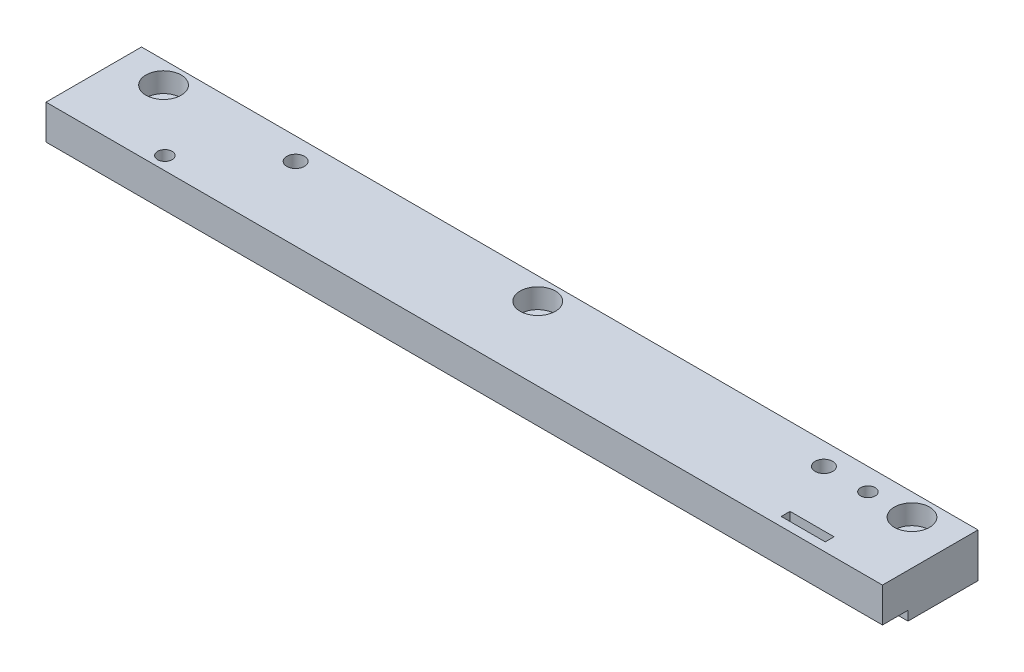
from build123d import *

# Parameters (mm, degrees)
SKETCH_1_W          = 190
SKETCH_1_H          = 10
EXTRUDE_1_DEPTH     = 21.7
SKETCH_2_OUTSIDE_W  = 62
SKETCH_2_OUTSIDE_H  = 50.3
CUT_EXTRUDE_1_DEPTH = 192.496449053
SKETCH_3_R          = 2.25
SKETCH_3_R_2        = 2
SKETCH_3_R_3        = 1.65
SKETCH_3_W          = 10
SKETCH_3_H          = 2
CUT_EXTRUDE_2_DEPTH = 21.7
SKETCH_4_R          = 4
CUT_EXTRUDE_3_DEPTH = 4.5


with BuildPart() as part:
    # Sketch 1 → Extrude 1 (new body)
    with BuildSketch(Plane.XY):
        with Locations((95, 5)):
            Rectangle(SKETCH_1_W, SKETCH_1_H)
    extrude(amount=EXTRUDE_1_DEPTH)

    # Sketch 2 outside → Cut-Extrude 1 (cut, through all)
    with BuildSketch(Plane(origin=(190, 0, 0), x_dir=(0, 0, -1), z_dir=(1, 0, 0))):
        with Locations((-10.85, 5)):
            Rectangle(SKETCH_2_OUTSIDE_W, SKETCH_2_OUTSIDE_H)
        Polygon((0, 0), (0, 10), (-21.7, 10), (-21.7, 2.14), (-15.9, 2.14), (-15.9, 0), align=None, mode=Mode.SUBTRACT)
    extrude(amount=-CUT_EXTRUDE_1_DEPTH, mode=Mode.SUBTRACT)

    # Sketch 3 → Cut-Extrude 2 (cut)
    with BuildSketch(Plane(origin=(0, 10, 0), x_dir=(1, 0, 0), z_dir=(0, 1, 0))):
        with Locations(Location((10, -5, 0), (0, 0, 270))):
            Circle(SKETCH_3_R)
        with Locations(Location((95, -5, 0), (0, 0, 270))):
            Circle(SKETCH_3_R)
        with Locations(Location((180, -5, 0), (0, 0, 270))):
            Circle(SKETCH_3_R)
        with Locations(Location((40, -5, 0), (0, 0, 270))):
            Circle(SKETCH_3_R_2)
        with Locations(Location((160, -5, 0), (0, 0, 270))):
            Circle(SKETCH_3_R_2)
        with Locations(Location((170, -5, 0), (0, 0, 270))):
            Circle(SKETCH_3_R_3)
        with Locations(Location((24, -18.7, 0), (0, 0, 270))):
            Circle(SKETCH_3_R_3)
        with Locations((170, -18.7)):
            Rectangle(SKETCH_3_W, SKETCH_3_H)
    extrude(amount=-CUT_EXTRUDE_2_DEPTH, mode=Mode.SUBTRACT)

    # Sketch 4 → Cut-Extrude 3 (cut)
    with BuildSketch(Plane(origin=(0, 10, 0), x_dir=(1, 0, 0), z_dir=(0, 1, 0))):
        with Locations(Location((10, -5, 0), (0, 0, 270))):
            Circle(SKETCH_4_R)
        with Locations(Location((95, -5, 0), (0, 0, 270))):
            Circle(SKETCH_4_R)
        with Locations(Location((180, -5, 0), (0, 0, 270))):
            Circle(SKETCH_4_R)
    extrude(amount=-CUT_EXTRUDE_3_DEPTH, mode=Mode.SUBTRACT)


solid = part.part
